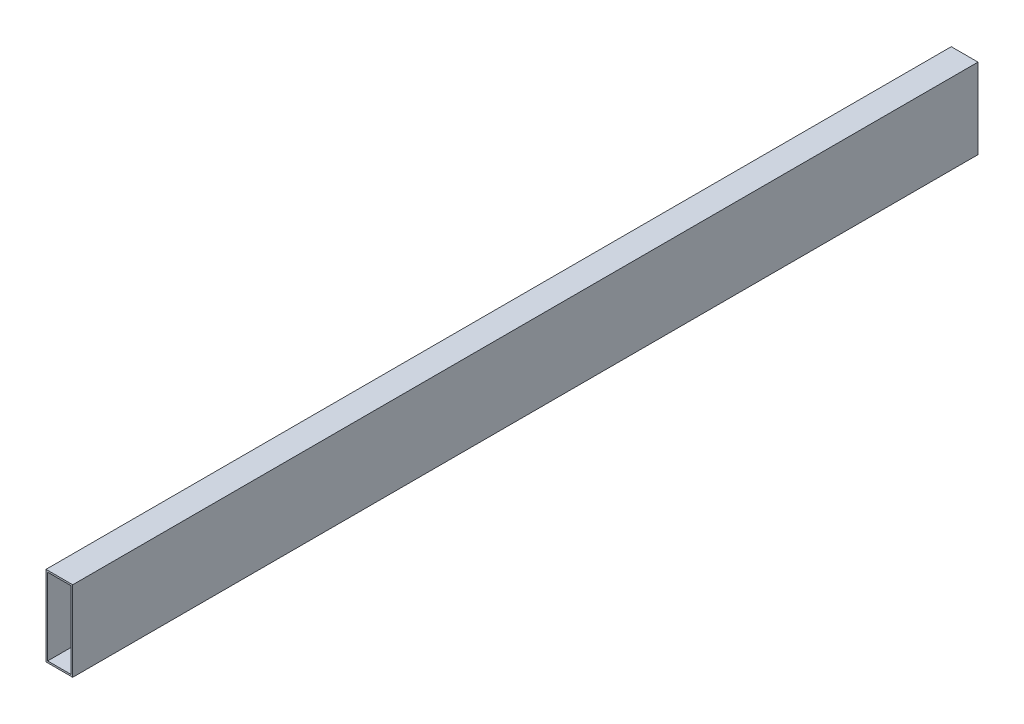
from build123d import *

# Parameters (mm, degrees)
SKETCH1_W           = 50.8
SKETCH1_H           = 152.4
SKETCH1_W_2         = 44.45
SKETCH1_H_2         = 146.05
BOSS_EXTRUDE1_DEPTH = 1720.85


with BuildPart() as part:
    # Sketch1 → Boss-Extrude1 (new body)
    with BuildSketch(Plane.XY.offset(1720.85)):
        with Locations((25.4, 76.2)):
            Rectangle(SKETCH1_W, SKETCH1_H)
        with Locations((25.4, 76.2)):
            Rectangle(SKETCH1_W_2, SKETCH1_H_2, mode=Mode.SUBTRACT)
    extrude(amount=-BOSS_EXTRUDE1_DEPTH)


solid = part.part
